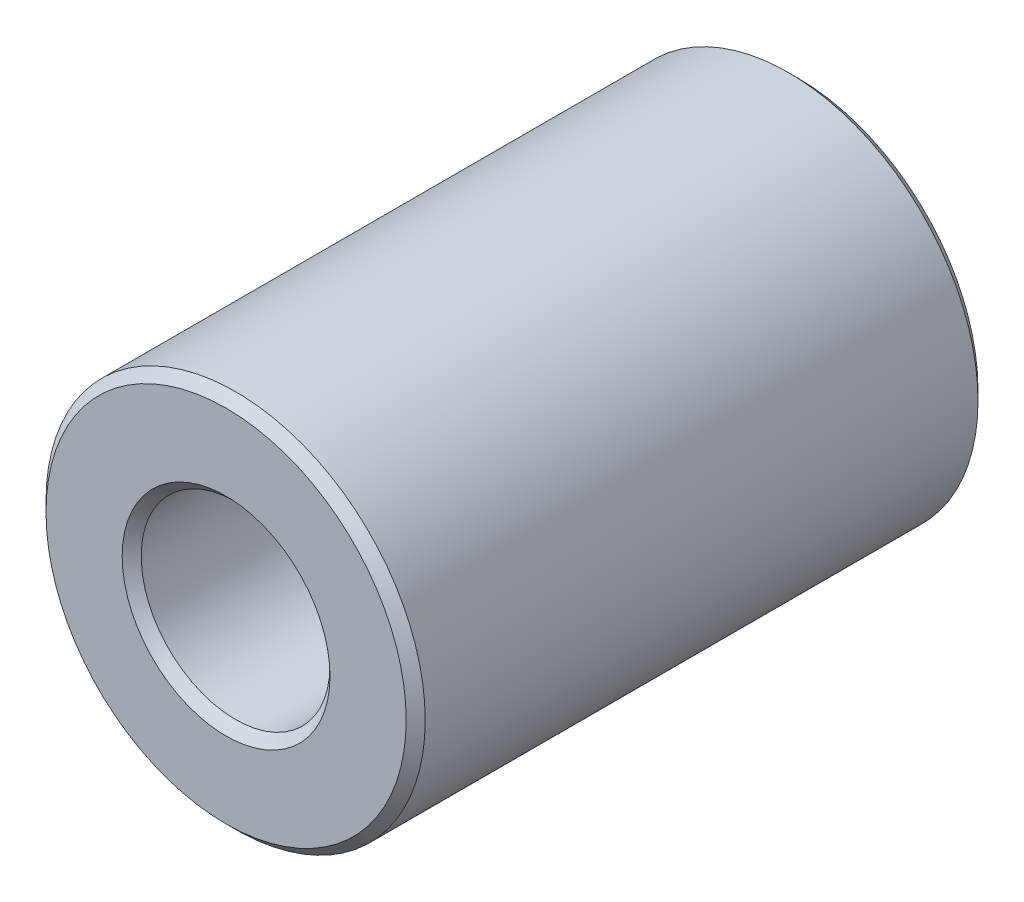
ISO-10303-21;
HEADER;
FILE_DESCRIPTION(('STEP AP214'),'2;1');
FILE_NAME('part.step','',(''),(''),'','','');
FILE_SCHEMA(('AUTOMOTIVE_DESIGN { 1 0 10303 214 1 1 1 1 }'));
ENDSEC;
DATA;
#1=APPLICATION_CONTEXT('core data for automotive mechanical design processes');
#2=APPLICATION_PROTOCOL_DEFINITION('international standard','automotive_design',2000,#1);
#3=PRODUCT_CONTEXT('',#1,'mechanical');
#4=PRODUCT('Part','Part','',(#3));
#5=PRODUCT_RELATED_PRODUCT_CATEGORY('part','',(#4));
#6=PRODUCT_DEFINITION_FORMATION('','',#4);
#7=PRODUCT_DEFINITION_CONTEXT('part definition',#1,'design');
#8=PRODUCT_DEFINITION('design','',#6,#7);
#9=PRODUCT_DEFINITION_SHAPE('','',#8);
#10=(LENGTH_UNIT() NAMED_UNIT(*) SI_UNIT(.MILLI.,.METRE.));
#11=(NAMED_UNIT(*) PLANE_ANGLE_UNIT() SI_UNIT($,.RADIAN.));
#12=(NAMED_UNIT(*) SI_UNIT($,.STERADIAN.) SOLID_ANGLE_UNIT());
#13=UNCERTAINTY_MEASURE_WITH_UNIT(LENGTH_MEASURE(1.E-05),#10,'distance_accuracy_value','');
#14=(GEOMETRIC_REPRESENTATION_CONTEXT(3) GLOBAL_UNCERTAINTY_ASSIGNED_CONTEXT((#13)) GLOBAL_UNIT_ASSIGNED_CONTEXT((#10,
#11,#12)) REPRESENTATION_CONTEXT('',''));
#15=CARTESIAN_POINT('',(0.,0.,0.));
#16=DIRECTION('',(0.,0.,1.));
#17=DIRECTION('',(1.,0.,0.));
#18=AXIS2_PLACEMENT_3D('',#15,#16,#17);
#19=CARTESIAN_POINT('',(0.,0.,-7.54));
#20=DIRECTION('',(0.,0.,1.));
#21=DIRECTION('',(1.,0.,0.));
#22=AXIS2_PLACEMENT_3D('',#19,#20,#21);
#23=CYLINDRICAL_SURFACE('',#22,5.);
#24=CARTESIAN_POINT('',(0.,0.,7.28892));
#25=DIRECTION('',(0.,0.,1.));
#26=DIRECTION('',(1.,0.,0.));
#27=AXIS2_PLACEMENT_3D('',#24,#25,#26);
#28=CIRCLE('',#27,5.);
#29=CARTESIAN_POINT('',(-5.,0.,7.28892));
#30=VERTEX_POINT('',#29);
#31=EDGE_CURVE('E55',#30,#30,#28,.F.);
#32=ORIENTED_EDGE('',*,*,#31,.T.);
#33=EDGE_LOOP('',(#32));
#34=FACE_BOUND('',#33,.T.);
#35=CARTESIAN_POINT('',(0.,0.,-7.28892));
#36=DIRECTION('',(0.,0.,1.));
#37=DIRECTION('',(1.,0.,0.));
#38=AXIS2_PLACEMENT_3D('',#35,#36,#37);
#39=CIRCLE('',#38,5.);
#40=CARTESIAN_POINT('',(5.,0.,-7.28892));
#41=VERTEX_POINT('',#40);
#42=EDGE_CURVE('E58',#41,#41,#39,.T.);
#43=ORIENTED_EDGE('',*,*,#42,.T.);
#44=EDGE_LOOP('',(#43));
#45=FACE_BOUND('',#44,.T.);
#46=ADVANCED_FACE('F35',(#34,#45),#23,.T.);
#47=CARTESIAN_POINT('',(0.,0.,-7.54));
#48=DIRECTION('',(0.,0.,1.));
#49=DIRECTION('',(1.,0.,0.));
#50=AXIS2_PLACEMENT_3D('',#47,#48,#49);
#51=PLANE('',#50);
#52=CARTESIAN_POINT('',(0.,0.,-7.54));
#53=DIRECTION('',(0.,0.,1.));
#54=DIRECTION('',(1.,0.,0.));
#55=AXIS2_PLACEMENT_3D('',#52,#53,#54);
#56=CIRCLE('',#55,4.74892);
#57=CARTESIAN_POINT('',(4.74892,0.,-7.54));
#58=VERTEX_POINT('',#57);
#59=EDGE_CURVE('E46',#58,#58,#56,.F.);
#60=ORIENTED_EDGE('',*,*,#59,.T.);
#61=EDGE_LOOP('',(#60));
#62=FACE_BOUND('',#61,.T.);
#63=CARTESIAN_POINT('',(0.,0.,-7.54));
#64=DIRECTION('',(0.,0.,1.));
#65=DIRECTION('',(1.,0.,0.));
#66=AXIS2_PLACEMENT_3D('',#63,#64,#65);
#67=CIRCLE('',#66,2.74028);
#68=CARTESIAN_POINT('',(2.74028,0.,-7.54));
#69=VERTEX_POINT('',#68);
#70=EDGE_CURVE('E50',#69,#69,#67,.T.);
#71=ORIENTED_EDGE('',*,*,#70,.T.);
#72=EDGE_LOOP('',(#71));
#73=FACE_BOUND('',#72,.T.);
#74=ADVANCED_FACE('F83',(#62,#73),#51,.F.);
#75=CARTESIAN_POINT('',(0.,0.,-7.54));
#76=DIRECTION('',(0.,0.,1.));
#77=DIRECTION('',(1.,0.,0.));
#78=AXIS2_PLACEMENT_3D('',#75,#76,#77);
#79=CYLINDRICAL_SURFACE('',#78,2.4892);
#80=CARTESIAN_POINT('',(0.,0.,7.28892));
#81=DIRECTION('',(0.,0.,1.));
#82=DIRECTION('',(1.,0.,0.));
#83=AXIS2_PLACEMENT_3D('',#80,#81,#82);
#84=CIRCLE('',#83,2.4892);
#85=CARTESIAN_POINT('',(2.4892,0.,7.28892));
#86=VERTEX_POINT('',#85);
#87=EDGE_CURVE('E10',#86,#86,#84,.T.);
#88=ORIENTED_EDGE('',*,*,#87,.T.);
#89=EDGE_LOOP('',(#88));
#90=FACE_BOUND('',#89,.T.);
#91=CARTESIAN_POINT('',(0.,0.,-7.28891999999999));
#92=DIRECTION('',(0.,0.,1.));
#93=DIRECTION('',(1.,0.,0.));
#94=AXIS2_PLACEMENT_3D('',#91,#92,#93);
#95=CIRCLE('',#94,2.4892);
#96=CARTESIAN_POINT('',(2.4892,0.,-7.28891999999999));
#97=VERTEX_POINT('',#96);
#98=EDGE_CURVE('E42',#97,#97,#95,.F.);
#99=ORIENTED_EDGE('',*,*,#98,.T.);
#100=EDGE_LOOP('',(#99));
#101=FACE_BOUND('',#100,.T.);
#102=ADVANCED_FACE('F89',(#90,#101),#79,.F.);
#103=CARTESIAN_POINT('',(0.,0.,7.54));
#104=DIRECTION('',(0.,0.,1.));
#105=DIRECTION('',(1.,0.,0.));
#106=AXIS2_PLACEMENT_3D('',#103,#104,#105);
#107=PLANE('',#106);
#108=CARTESIAN_POINT('',(0.,0.,7.54));
#109=DIRECTION('',(0.,0.,1.));
#110=DIRECTION('',(1.,0.,0.));
#111=AXIS2_PLACEMENT_3D('',#108,#109,#110);
#112=CIRCLE('',#111,4.74892);
#113=CARTESIAN_POINT('',(-4.74892,0.,7.54));
#114=VERTEX_POINT('',#113);
#115=EDGE_CURVE('E61',#114,#114,#112,.T.);
#116=ORIENTED_EDGE('',*,*,#115,.T.);
#117=EDGE_LOOP('',(#116));
#118=FACE_BOUND('',#117,.T.);
#119=CARTESIAN_POINT('',(0.,0.,7.54));
#120=DIRECTION('',(0.,0.,1.));
#121=DIRECTION('',(1.,0.,0.));
#122=AXIS2_PLACEMENT_3D('',#119,#120,#121);
#123=CIRCLE('',#122,2.74028);
#124=CARTESIAN_POINT('',(2.74028,0.,7.54));
#125=VERTEX_POINT('',#124);
#126=EDGE_CURVE('E64',#125,#125,#123,.F.);
#127=ORIENTED_EDGE('',*,*,#126,.T.);
#128=EDGE_LOOP('',(#127));
#129=FACE_BOUND('',#128,.T.);
#130=ADVANCED_FACE('F68',(#118,#129),#107,.T.);
#131=CARTESIAN_POINT('',(0.,0.,7.54));
#132=DIRECTION('',(0.,0.,-1.));
#133=DIRECTION('',(-1.,0.,0.));
#134=AXIS2_PLACEMENT_3D('',#131,#132,#133);
#135=CONICAL_SURFACE('',#134,4.74892,0.78539816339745);
#136=CARTESIAN_POINT('',(-5.,0.,7.28892));
#137=CARTESIAN_POINT('',(-4.99738458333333,0.,7.29153541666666));
#138=CARTESIAN_POINT('',(-4.99476916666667,0.,7.29415083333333));
#139=CARTESIAN_POINT('',(-4.98953833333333,0.,7.29938166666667));
#140=CARTESIAN_POINT('',(-4.98692291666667,0.,7.30199708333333));
#141=CARTESIAN_POINT('',(-4.98169208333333,0.,7.30722791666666));
#142=CARTESIAN_POINT('',(-4.97907666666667,0.,7.30984333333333));
#143=CARTESIAN_POINT('',(-4.97384583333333,0.,7.31507416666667));
#144=CARTESIAN_POINT('',(-4.97123041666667,0.,7.31768958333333));
#145=CARTESIAN_POINT('',(-4.96599958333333,0.,7.32292041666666));
#146=CARTESIAN_POINT('',(-4.96338416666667,0.,7.32553583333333));
#147=CARTESIAN_POINT('',(-4.95815333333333,0.,7.33076666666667));
#148=CARTESIAN_POINT('',(-4.95553791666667,0.,7.33338208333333));
#149=CARTESIAN_POINT('',(-4.95030708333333,0.,7.33861291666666));
#150=CARTESIAN_POINT('',(-4.94769166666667,0.,7.34122833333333));
#151=CARTESIAN_POINT('',(-4.94246083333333,0.,7.34645916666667));
#152=CARTESIAN_POINT('',(-4.93984541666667,0.,7.34907458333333));
#153=CARTESIAN_POINT('',(-4.93461458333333,0.,7.35430541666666));
#154=CARTESIAN_POINT('',(-4.93199916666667,0.,7.35692083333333));
#155=CARTESIAN_POINT('',(-4.92676833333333,0.,7.36215166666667));
#156=CARTESIAN_POINT('',(-4.92415291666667,0.,7.36476708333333));
#157=CARTESIAN_POINT('',(-4.91892208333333,0.,7.36999791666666));
#158=CARTESIAN_POINT('',(-4.91630666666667,0.,7.37261333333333));
#159=CARTESIAN_POINT('',(-4.91107583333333,0.,7.37784416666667));
#160=CARTESIAN_POINT('',(-4.90846041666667,0.,7.38045958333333));
#161=CARTESIAN_POINT('',(-4.90322958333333,0.,7.38569041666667));
#162=CARTESIAN_POINT('',(-4.90061416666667,0.,7.38830583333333));
#163=CARTESIAN_POINT('',(-4.89538333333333,0.,7.39353666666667));
#164=CARTESIAN_POINT('',(-4.89276791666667,0.,7.39615208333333));
#165=CARTESIAN_POINT('',(-4.88753708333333,0.,7.40138291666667));
#166=CARTESIAN_POINT('',(-4.88492166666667,0.,7.40399833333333));
#167=CARTESIAN_POINT('',(-4.87969083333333,0.,7.40922916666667));
#168=CARTESIAN_POINT('',(-4.87707541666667,0.,7.41184458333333));
#169=CARTESIAN_POINT('',(-4.87184458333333,0.,7.41707541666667));
#170=CARTESIAN_POINT('',(-4.86922916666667,0.,7.41969083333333));
#171=CARTESIAN_POINT('',(-4.86399833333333,0.,7.42492166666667));
#172=CARTESIAN_POINT('',(-4.86138291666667,0.,7.42753708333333));
#173=CARTESIAN_POINT('',(-4.85615208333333,0.,7.43276791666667));
#174=CARTESIAN_POINT('',(-4.85353666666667,0.,7.43538333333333));
#175=CARTESIAN_POINT('',(-4.84830583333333,0.,7.44061416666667));
#176=CARTESIAN_POINT('',(-4.84569041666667,0.,7.44322958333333));
#177=CARTESIAN_POINT('',(-4.84045958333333,0.,7.44846041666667));
#178=CARTESIAN_POINT('',(-4.83784416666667,0.,7.45107583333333));
#179=CARTESIAN_POINT('',(-4.83261333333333,0.,7.45630666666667));
#180=CARTESIAN_POINT('',(-4.82999791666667,0.,7.45892208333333));
#181=CARTESIAN_POINT('',(-4.82476708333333,0.,7.46415291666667));
#182=CARTESIAN_POINT('',(-4.82215166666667,0.,7.46676833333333));
#183=CARTESIAN_POINT('',(-4.81692083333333,0.,7.47199916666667));
#184=CARTESIAN_POINT('',(-4.81430541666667,0.,7.47461458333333));
#185=CARTESIAN_POINT('',(-4.80907458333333,0.,7.47984541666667));
#186=CARTESIAN_POINT('',(-4.80645916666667,0.,7.48246083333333));
#187=CARTESIAN_POINT('',(-4.80122833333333,0.,7.48769166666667));
#188=CARTESIAN_POINT('',(-4.79861291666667,0.,7.49030708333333));
#189=CARTESIAN_POINT('',(-4.79338208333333,0.,7.49553791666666));
#190=CARTESIAN_POINT('',(-4.79076666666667,0.,7.49815333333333));
#191=CARTESIAN_POINT('',(-4.78553583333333,0.,7.50338416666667));
#192=CARTESIAN_POINT('',(-4.78292041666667,0.,7.50599958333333));
#193=CARTESIAN_POINT('',(-4.77768958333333,0.,7.51123041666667));
#194=CARTESIAN_POINT('',(-4.77507416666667,0.,7.51384583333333));
#195=CARTESIAN_POINT('',(-4.76984333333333,0.,7.51907666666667));
#196=CARTESIAN_POINT('',(-4.76722791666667,0.,7.52169208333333));
#197=CARTESIAN_POINT('',(-4.76199708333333,0.,7.52692291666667));
#198=CARTESIAN_POINT('',(-4.75938166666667,0.,7.52953833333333));
#199=CARTESIAN_POINT('',(-4.75415083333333,0.,7.53476916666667));
#200=CARTESIAN_POINT('',(-4.75153541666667,0.,7.53738458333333));
#201=CARTESIAN_POINT('',(-4.74892,0.,7.54));
#202=B_SPLINE_CURVE_WITH_KNOTS('',3,(#136,#137,#138,#139,#140,#141,#142,#143,#144,#145,#146,
#147,#148,#149,#150,#151,#152,#153,#154,#155,#156,#157,#158,#159,#160,#161,#162,#163,#164,#165,
#166,#167,#168,#169,#170,#171,#172,#173,#174,#175,#176,#177,#178,#179,#180,#181,#182,#183,#184,
#185,#186,#187,#188,#189,#190,#191,#192,#193,#194,#195,#196,#197,#198,#199,#200,#201),
.UNSPECIFIED.,.F.,.F.,(4,2,2,2,2,2,2,2,2,2,2,2,2,2,2,2,2,2,2,2,2,2,2,2,2,2,2,2,2,2,2,2,4),(0.,
0.0110962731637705,0.0221925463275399,0.0332888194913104,0.0443850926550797,0.0554813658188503,
0.0665776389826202,0.0776739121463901,0.0887701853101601,0.09986645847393,0.1109627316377,
0.12205900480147,0.13315527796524,0.14425155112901,0.15534782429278,0.16644409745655,
0.17754037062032,0.188636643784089,0.199732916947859,0.21082919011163,0.221925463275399,
0.23302173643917,0.244118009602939,0.25521428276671,0.266310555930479,0.27740682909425,
0.288503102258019,0.299599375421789,0.310695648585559,0.321791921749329,0.332888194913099,
0.343984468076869,0.355080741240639),.UNSPECIFIED.);
#203=EDGE_CURVE('BSEAM79',#30,#114,#202,.T.);
#204=ORIENTED_EDGE('',*,*,#31,.F.);
#205=ORIENTED_EDGE('',*,*,#115,.F.);
#206=ORIENTED_EDGE('',*,*,#203,.T.);
#207=ORIENTED_EDGE('',*,*,#203,.F.);
#208=EDGE_LOOP('',(#204,#206,#205,#207));
#209=FACE_BOUND('',#208,.T.);
#210=ADVANCED_FACE('F79',(#209),#135,.T.);
#211=CARTESIAN_POINT('',(0.,0.,-7.28892));
#212=DIRECTION('',(0.,0.,1.));
#213=DIRECTION('',(1.,0.,0.));
#214=AXIS2_PLACEMENT_3D('',#211,#212,#213);
#215=CONICAL_SURFACE('',#214,5.,0.785398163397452);
#216=ORIENTED_EDGE('',*,*,#59,.F.);
#217=EDGE_LOOP('',(#216));
#218=FACE_BOUND('',#217,.T.);
#219=ORIENTED_EDGE('',*,*,#42,.F.);
#220=EDGE_LOOP('',(#219));
#221=FACE_BOUND('',#220,.T.);
#222=ADVANCED_FACE('F73',(#218,#221),#215,.T.);
#223=CARTESIAN_POINT('',(0.,0.,7.28892));
#224=DIRECTION('',(0.,0.,1.));
#225=DIRECTION('',(1.,0.,0.));
#226=AXIS2_PLACEMENT_3D('',#223,#224,#225);
#227=CONICAL_SURFACE('',#226,2.4892,0.785398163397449);
#228=CARTESIAN_POINT('',(2.74028,0.,7.54));
#229=CARTESIAN_POINT('',(2.73766458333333,0.,7.53738458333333));
#230=CARTESIAN_POINT('',(2.73504916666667,0.,7.53476916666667));
#231=CARTESIAN_POINT('',(2.72981833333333,0.,7.52953833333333));
#232=CARTESIAN_POINT('',(2.72720291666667,0.,7.52692291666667));
#233=CARTESIAN_POINT('',(2.72197208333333,0.,7.52169208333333));
#234=CARTESIAN_POINT('',(2.71935666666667,0.,7.51907666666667));
#235=CARTESIAN_POINT('',(2.71412583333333,0.,7.51384583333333));
#236=CARTESIAN_POINT('',(2.71151041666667,0.,7.51123041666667));
#237=CARTESIAN_POINT('',(2.70627958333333,0.,7.50599958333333));
#238=CARTESIAN_POINT('',(2.70366416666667,0.,7.50338416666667));
#239=CARTESIAN_POINT('',(2.69843333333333,0.,7.49815333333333));
#240=CARTESIAN_POINT('',(2.69581791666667,0.,7.49553791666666));
#241=CARTESIAN_POINT('',(2.69058708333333,0.,7.49030708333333));
#242=CARTESIAN_POINT('',(2.68797166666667,0.,7.48769166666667));
#243=CARTESIAN_POINT('',(2.68274083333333,0.,7.48246083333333));
#244=CARTESIAN_POINT('',(2.68012541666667,0.,7.47984541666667));
#245=CARTESIAN_POINT('',(2.67489458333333,0.,7.47461458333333));
#246=CARTESIAN_POINT('',(2.67227916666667,0.,7.47199916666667));
#247=CARTESIAN_POINT('',(2.66704833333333,0.,7.46676833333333));
#248=CARTESIAN_POINT('',(2.66443291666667,0.,7.46415291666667));
#249=CARTESIAN_POINT('',(2.65920208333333,0.,7.45892208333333));
#250=CARTESIAN_POINT('',(2.65658666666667,0.,7.45630666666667));
#251=CARTESIAN_POINT('',(2.65135583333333,0.,7.45107583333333));
#252=CARTESIAN_POINT('',(2.64874041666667,0.,7.44846041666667));
#253=CARTESIAN_POINT('',(2.64350958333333,0.,7.44322958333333));
#254=CARTESIAN_POINT('',(2.64089416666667,0.,7.44061416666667));
#255=CARTESIAN_POINT('',(2.63566333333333,0.,7.43538333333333));
#256=CARTESIAN_POINT('',(2.63304791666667,0.,7.43276791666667));
#257=CARTESIAN_POINT('',(2.62781708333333,0.,7.42753708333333));
#258=CARTESIAN_POINT('',(2.62520166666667,0.,7.42492166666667));
#259=CARTESIAN_POINT('',(2.61997083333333,0.,7.41969083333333));
#260=CARTESIAN_POINT('',(2.61735541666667,0.,7.41707541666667));
#261=CARTESIAN_POINT('',(2.61212458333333,0.,7.41184458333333));
#262=CARTESIAN_POINT('',(2.60950916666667,0.,7.40922916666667));
#263=CARTESIAN_POINT('',(2.60427833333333,0.,7.40399833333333));
#264=CARTESIAN_POINT('',(2.60166291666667,0.,7.40138291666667));
#265=CARTESIAN_POINT('',(2.59643208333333,0.,7.39615208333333));
#266=CARTESIAN_POINT('',(2.59381666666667,0.,7.39353666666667));
#267=CARTESIAN_POINT('',(2.58858583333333,0.,7.38830583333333));
#268=CARTESIAN_POINT('',(2.58597041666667,0.,7.38569041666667));
#269=CARTESIAN_POINT('',(2.58073958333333,0.,7.38045958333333));
#270=CARTESIAN_POINT('',(2.57812416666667,0.,7.37784416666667));
#271=CARTESIAN_POINT('',(2.57289333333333,0.,7.37261333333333));
#272=CARTESIAN_POINT('',(2.57027791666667,0.,7.36999791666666));
#273=CARTESIAN_POINT('',(2.56504708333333,0.,7.36476708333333));
#274=CARTESIAN_POINT('',(2.56243166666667,0.,7.36215166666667));
#275=CARTESIAN_POINT('',(2.55720083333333,0.,7.35692083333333));
#276=CARTESIAN_POINT('',(2.55458541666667,0.,7.35430541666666));
#277=CARTESIAN_POINT('',(2.54935458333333,0.,7.34907458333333));
#278=CARTESIAN_POINT('',(2.54673916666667,0.,7.34645916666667));
#279=CARTESIAN_POINT('',(2.54150833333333,0.,7.34122833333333));
#280=CARTESIAN_POINT('',(2.53889291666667,0.,7.33861291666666));
#281=CARTESIAN_POINT('',(2.53366208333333,0.,7.33338208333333));
#282=CARTESIAN_POINT('',(2.53104666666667,0.,7.33076666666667));
#283=CARTESIAN_POINT('',(2.52581583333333,0.,7.32553583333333));
#284=CARTESIAN_POINT('',(2.52320041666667,0.,7.32292041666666));
#285=CARTESIAN_POINT('',(2.51796958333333,0.,7.31768958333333));
#286=CARTESIAN_POINT('',(2.51535416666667,0.,7.31507416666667));
#287=CARTESIAN_POINT('',(2.51012333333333,0.,7.30984333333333));
#288=CARTESIAN_POINT('',(2.50750791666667,0.,7.30722791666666));
#289=CARTESIAN_POINT('',(2.50227708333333,0.,7.30199708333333));
#290=CARTESIAN_POINT('',(2.49966166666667,0.,7.29938166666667));
#291=CARTESIAN_POINT('',(2.49443083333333,0.,7.29415083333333));
#292=CARTESIAN_POINT('',(2.49181541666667,0.,7.29153541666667));
#293=CARTESIAN_POINT('',(2.4892,0.,7.28892));
#294=B_SPLINE_CURVE_WITH_KNOTS('',3,(#228,#229,#230,#231,#232,#233,#234,#235,#236,#237,#238,
#239,#240,#241,#242,#243,#244,#245,#246,#247,#248,#249,#250,#251,#252,#253,#254,#255,#256,#257,
#258,#259,#260,#261,#262,#263,#264,#265,#266,#267,#268,#269,#270,#271,#272,#273,#274,#275,#276,
#277,#278,#279,#280,#281,#282,#283,#284,#285,#286,#287,#288,#289,#290,#291,#292,#293),
.UNSPECIFIED.,.F.,.F.,(4,2,2,2,2,2,2,2,2,2,2,2,2,2,2,2,2,2,2,2,2,2,2,2,2,2,2,2,2,2,2,2,4),(0.,
0.0110962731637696,0.0221925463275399,0.0332888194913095,0.0443850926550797,0.0554813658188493,
0.0665776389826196,0.0776739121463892,0.0887701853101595,0.0998664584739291,0.110962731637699,
0.122059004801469,0.133155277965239,0.144251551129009,0.155347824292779,0.166444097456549,
0.177540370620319,0.188636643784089,0.199732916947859,0.210829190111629,0.221925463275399,
0.233021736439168,0.244118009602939,0.255214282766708,0.266310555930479,0.277406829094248,
0.288503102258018,0.299599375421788,0.310695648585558,0.321791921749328,0.332888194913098,
0.343984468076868,0.355080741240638),.UNSPECIFIED.);
#295=EDGE_CURVE('BSEAM70',#125,#86,#294,.T.);
#296=ORIENTED_EDGE('',*,*,#126,.F.);
#297=ORIENTED_EDGE('',*,*,#87,.F.);
#298=ORIENTED_EDGE('',*,*,#295,.T.);
#299=ORIENTED_EDGE('',*,*,#295,.F.);
#300=EDGE_LOOP('',(#296,#298,#297,#299));
#301=FACE_BOUND('',#300,.T.);
#302=ADVANCED_FACE('F70',(#301),#227,.F.);
#303=CARTESIAN_POINT('',(0.,0.,-7.54));
#304=DIRECTION('',(0.,0.,-1.));
#305=DIRECTION('',(-1.,0.,0.));
#306=AXIS2_PLACEMENT_3D('',#303,#304,#305);
#307=CONICAL_SURFACE('',#306,2.74028,0.785398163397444);
#308=ORIENTED_EDGE('',*,*,#98,.F.);
#309=EDGE_LOOP('',(#308));
#310=FACE_BOUND('',#309,.T.);
#311=ORIENTED_EDGE('',*,*,#70,.F.);
#312=EDGE_LOOP('',(#311));
#313=FACE_BOUND('',#312,.T.);
#314=ADVANCED_FACE('F37',(#310,#313),#307,.F.);
#315=CLOSED_SHELL('',(#46,#74,#102,#130,#210,#222,#302,#314));
#316=MANIFOLD_SOLID_BREP('B2',#315);
#317=ADVANCED_BREP_SHAPE_REPRESENTATION('',(#18,#316),#14);
#318=SHAPE_DEFINITION_REPRESENTATION(#9,#317);
ENDSEC;
END-ISO-10303-21;
